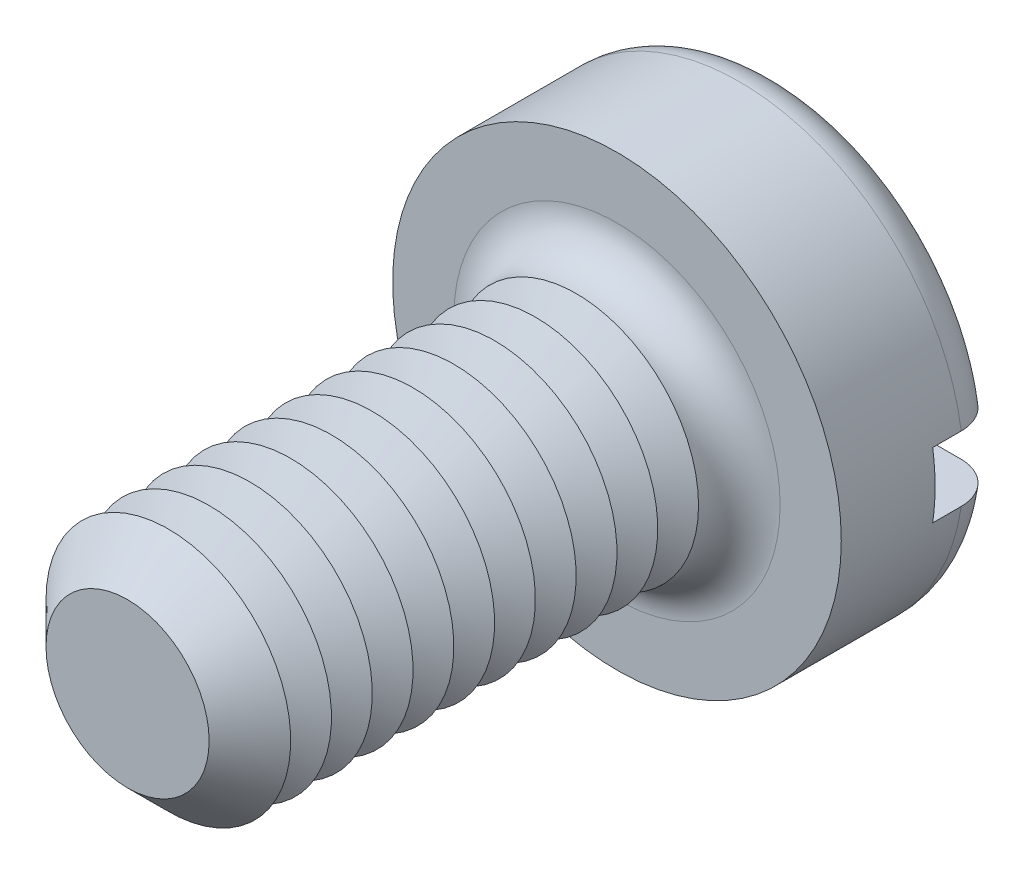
ISO-10303-21;
HEADER;
FILE_DESCRIPTION(('STEP AP214'),'2;1');
FILE_NAME('part.step','',(''),(''),'','','');
FILE_SCHEMA(('AUTOMOTIVE_DESIGN { 1 0 10303 214 1 1 1 1 }'));
ENDSEC;
DATA;
#1=APPLICATION_CONTEXT('core data for automotive mechanical design processes');
#2=APPLICATION_PROTOCOL_DEFINITION('international standard','automotive_design',2000,#1);
#3=PRODUCT_CONTEXT('',#1,'mechanical');
#4=PRODUCT('Part','Part','',(#3));
#5=PRODUCT_RELATED_PRODUCT_CATEGORY('part','',(#4));
#6=PRODUCT_DEFINITION_FORMATION('','',#4);
#7=PRODUCT_DEFINITION_CONTEXT('part definition',#1,'design');
#8=PRODUCT_DEFINITION('design','',#6,#7);
#9=PRODUCT_DEFINITION_SHAPE('','',#8);
#10=(LENGTH_UNIT() NAMED_UNIT(*) SI_UNIT(.MILLI.,.METRE.));
#11=(NAMED_UNIT(*) PLANE_ANGLE_UNIT() SI_UNIT($,.RADIAN.));
#12=(NAMED_UNIT(*) SI_UNIT($,.STERADIAN.) SOLID_ANGLE_UNIT());
#13=UNCERTAINTY_MEASURE_WITH_UNIT(LENGTH_MEASURE(1.E-05),#10,'distance_accuracy_value','');
#14=(GEOMETRIC_REPRESENTATION_CONTEXT(3) GLOBAL_UNCERTAINTY_ASSIGNED_CONTEXT((#13)) GLOBAL_UNIT_ASSIGNED_CONTEXT((#10,
#11,#12)) REPRESENTATION_CONTEXT('',''));
#15=CARTESIAN_POINT('',(0.,0.,0.));
#16=DIRECTION('',(0.,0.,1.));
#17=DIRECTION('',(1.,0.,0.));
#18=AXIS2_PLACEMENT_3D('',#15,#16,#17);
#19=CARTESIAN_POINT('',(0.,0.,-2.));
#20=DIRECTION('',(0.,0.,1.));
#21=DIRECTION('',(1.,0.,0.));
#22=AXIS2_PLACEMENT_3D('',#19,#20,#21);
#23=PLANE('',#22);
#24=CARTESIAN_POINT('',(0.,0.,-2.));
#25=DIRECTION('',(0.,0.,1.));
#26=DIRECTION('',(1.,0.,0.));
#27=AXIS2_PLACEMENT_3D('',#24,#25,#26);
#28=CIRCLE('',#27,2.25);
#29=CARTESIAN_POINT('',(-2.21415898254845,0.4,-2.));
#30=VERTEX_POINT('',#29);
#31=CARTESIAN_POINT('',(2.21415898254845,0.4,-2.));
#32=VERTEX_POINT('',#31);
#33=EDGE_CURVE('E116',#30,#32,#28,.F.);
#34=ORIENTED_EDGE('',*,*,#33,.T.);
#35=DIRECTION('',(1.,0.,0.));
#36=VECTOR('',#35,1.);
#37=CARTESIAN_POINT('',(-2.75,0.400000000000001,-2.));
#38=LINE('',#37,#36);
#39=EDGE_CURVE('E111',#30,#32,#38,.T.);
#40=ORIENTED_EDGE('',*,*,#39,.F.);
#41=EDGE_LOOP('',(#34,#40));
#42=FACE_BOUND('',#41,.T.);
#43=ADVANCED_FACE('F39',(#42),#23,.F.);
#44=CARTESIAN_POINT('',(0.,0.,-1.5));
#45=DIRECTION('',(0.,0.,1.));
#46=DIRECTION('',(1.,0.,0.));
#47=AXIS2_PLACEMENT_3D('',#44,#45,#46);
#48=TOROIDAL_SURFACE('',#47,2.25,0.5);
#49=CARTESIAN_POINT('',(-2.6296588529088,0.400000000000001,-1.78631483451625));
#50=CARTESIAN_POINT('',(-2.61332846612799,0.400000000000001,-1.80942627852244));
#51=CARTESIAN_POINT('',(-2.59501593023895,0.400000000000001,-1.83116426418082));
#52=CARTESIAN_POINT('',(-2.55497423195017,0.400000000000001,-1.87126271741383));
#53=CARTESIAN_POINT('',(-2.53324055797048,0.4,-1.88961865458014));
#54=CARTESIAN_POINT('',(-2.48702796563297,0.4,-1.92241505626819));
#55=CARTESIAN_POINT('',(-2.46255183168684,0.4,-1.93685944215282));
#56=CARTESIAN_POINT('',(-2.41154731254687,0.4,-1.96147315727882));
#57=CARTESIAN_POINT('',(-2.38501943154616,0.4,-1.97164353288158));
#58=CARTESIAN_POINT('',(-2.3303912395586,0.4,-1.98753780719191));
#59=CARTESIAN_POINT('',(-2.30227842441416,0.4,-1.99321871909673));
#60=CARTESIAN_POINT('',(-2.24549884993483,0.4,-1.99984170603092));
#61=CARTESIAN_POINT('',(-2.21683202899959,0.4,-2.00078325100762));
#62=CARTESIAN_POINT('',(-2.15939326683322,0.4,-1.99790249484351));
#63=CARTESIAN_POINT('',(-2.13062419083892,0.4,-1.99402290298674));
#64=CARTESIAN_POINT('',(-2.07413526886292,0.4,-1.98151915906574));
#65=CARTESIAN_POINT('',(-2.04641547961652,0.4,-1.97289475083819));
#66=CARTESIAN_POINT('',(-1.99264697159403,0.4,-1.95107177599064));
#67=CARTESIAN_POINT('',(-1.96660904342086,0.4,-1.93784659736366));
#68=CARTESIAN_POINT('',(-1.91713954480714,0.4,-1.90718730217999));
#69=CARTESIAN_POINT('',(-1.89370795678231,0.4,-1.88975321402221));
#70=CARTESIAN_POINT('',(-1.85029144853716,0.4,-1.85126548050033));
#71=CARTESIAN_POINT('',(-1.83028607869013,0.4,-1.83023492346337));
#72=CARTESIAN_POINT('',(-1.79417432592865,0.4,-1.78505552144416));
#73=CARTESIAN_POINT('',(-1.77806752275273,0.4,-1.76090701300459));
#74=CARTESIAN_POINT('',(-1.75056079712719,0.4,-1.71067721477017));
#75=CARTESIAN_POINT('',(-1.7390748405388,0.4,-1.68464306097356));
#76=CARTESIAN_POINT('',(-1.72075680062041,0.4,-1.63098625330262));
#77=CARTESIAN_POINT('',(-1.71392397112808,0.4,-1.60336385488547));
#78=CARTESIAN_POINT('',(-1.70525661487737,0.4,-1.54801066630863));
#79=CARTESIAN_POINT('',(-1.70330866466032,0.4,-1.52029759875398));
#80=CARTESIAN_POINT('',(-1.70414820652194,0.4,-1.46494458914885));
#81=CARTESIAN_POINT('',(-1.70693532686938,0.4,-1.43730464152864));
#82=CARTESIAN_POINT('',(-1.71709335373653,0.4,-1.38318389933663));
#83=CARTESIAN_POINT('',(-1.72441580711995,0.4,-1.35669397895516));
#84=CARTESIAN_POINT('',(-1.74335830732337,0.4,-1.30529964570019));
#85=CARTESIAN_POINT('',(-1.75497853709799,0.4,-1.2803953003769));
#86=CARTESIAN_POINT('',(-1.78229453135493,0.4,-1.23258298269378));
#87=CARTESIAN_POINT('',(-1.79803217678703,0.4,-1.20969896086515));
#88=CARTESIAN_POINT('',(-1.83304498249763,0.4,-1.16682064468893));
#89=CARTESIAN_POINT('',(-1.85232054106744,0.4,-1.1468266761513));
#90=CARTESIAN_POINT('',(-1.89433695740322,0.4,-1.10980713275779));
#91=CARTESIAN_POINT('',(-1.91714740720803,0.4,-1.09286053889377));
#92=CARTESIAN_POINT('',(-1.96524407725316,0.4,-1.06294809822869));
#93=CARTESIAN_POINT('',(-1.99053056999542,0.4,-1.04998269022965));
#94=CARTESIAN_POINT('',(-2.04340612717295,0.4,-1.02814800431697));
#95=CARTESIAN_POINT('',(-2.07103098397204,0.4,-1.01936532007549));
#96=CARTESIAN_POINT('',(-2.12735840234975,0.4,-1.00652373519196));
#97=CARTESIAN_POINT('',(-2.15606102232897,0.4,-1.00246509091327));
#98=CARTESIAN_POINT('',(-2.21395379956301,0.4,-0.999181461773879));
#99=CARTESIAN_POINT('',(-2.24314598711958,0.4,-0.999992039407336));
#100=CARTESIAN_POINT('',(-2.30097585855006,0.4,-1.00652779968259));
#101=CARTESIAN_POINT('',(-2.32961355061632,0.4,-1.01225290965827));
#102=CARTESIAN_POINT('',(-2.38536238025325,0.4,-1.02843951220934));
#103=CARTESIAN_POINT('',(-2.41248047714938,0.4,-1.03887701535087));
#104=CARTESIAN_POINT('',(-2.46454860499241,0.4,-1.06421009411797));
#105=CARTESIAN_POINT('',(-2.48949875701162,0.4,-1.0791054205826));
#106=CARTESIAN_POINT('',(-2.53620471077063,0.4,-1.11274531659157));
#107=CARTESIAN_POINT('',(-2.55799482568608,0.400000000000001,-1.1314422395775));
#108=CARTESIAN_POINT('',(-2.59807595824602,0.400000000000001,-1.17227176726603));
#109=CARTESIAN_POINT('',(-2.6163672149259,0.400000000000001,-1.19440413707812));
#110=CARTESIAN_POINT('',(-2.64868581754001,0.400000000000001,-1.24117072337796));
#111=CARTESIAN_POINT('',(-2.66276466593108,0.400000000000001,-1.26576935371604));
#112=CARTESIAN_POINT('',(-2.68654482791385,0.400000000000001,-1.31699754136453));
#113=CARTESIAN_POINT('',(-2.69624657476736,0.400000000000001,-1.34362689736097));
#114=CARTESIAN_POINT('',(-2.71090527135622,0.400000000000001,-1.39787706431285));
#115=CARTESIAN_POINT('',(-2.71590826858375,0.400000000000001,-1.4254854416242));
#116=CARTESIAN_POINT('',(-2.72118463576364,0.400000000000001,-1.48115803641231));
#117=CARTESIAN_POINT('',(-2.72145696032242,0.400000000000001,-1.50922235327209));
#118=CARTESIAN_POINT('',(-2.71727180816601,0.400000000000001,-1.56487271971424));
#119=CARTESIAN_POINT('',(-2.71283440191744,0.400000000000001,-1.59246029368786));
#120=CARTESIAN_POINT('',(-2.69939521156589,0.400000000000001,-1.64647499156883));
#121=CARTESIAN_POINT('',(-2.69039909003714,0.400000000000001,-1.67290351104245));
#122=CARTESIAN_POINT('',(-2.67251693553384,0.400000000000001,-1.71382731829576));
#123=CARTESIAN_POINT('',(-2.66497994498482,0.400000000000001,-1.72892686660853));
#124=CARTESIAN_POINT('',(-2.64841616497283,0.400000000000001,-1.75828509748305));
#125=CARTESIAN_POINT('',(-2.63938938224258,0.400000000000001,-1.77254378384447));
#126=CARTESIAN_POINT('',(-2.6296588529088,0.400000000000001,-1.78631483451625));
#127=B_SPLINE_CURVE_WITH_KNOTS('',3,(#49,#50,#51,#52,#53,#54,#55,#56,#57,#58,#59,#60,#61,#62,
#63,#64,#65,#66,#67,#68,#69,#70,#71,#72,#73,#74,#75,#76,#77,#78,#79,#80,#81,#82,#83,#84,#85,#86,
#87,#88,#89,#90,#91,#92,#93,#94,#95,#96,#97,#98,#99,#100,#101,#102,#103,#104,#105,#106,#107,
#108,#109,#110,#111,#112,#113,#114,#115,#116,#117,#118,#119,#120,#121,#122,#123,#124,#125,#126),
.UNSPECIFIED.,.T.,.F.,(4,2,2,2,2,2,2,2,2,2,2,2,2,2,2,2,2,2,2,2,2,2,2,2,2,2,2,2,2,2,2,2,2,2,2,2,
2,2,4),(0.,0.0848338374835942,0.16978050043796,0.254641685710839,0.339482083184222,
0.42512530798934,0.510778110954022,0.597458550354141,0.684143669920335,0.771338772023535,
0.858533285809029,0.945187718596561,1.03183280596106,1.11678035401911,1.20171427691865,
1.28465703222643,1.36759327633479,1.4496584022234,1.53172702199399,1.61466526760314,
1.69761285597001,1.78247103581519,1.86733856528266,1.95389396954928,2.0404540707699,
2.12764713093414,2.21483890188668,2.30159172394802,2.38833969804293,2.4740609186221,
2.55977628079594,2.6443962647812,2.72900787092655,2.81278135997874,2.89657336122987,
2.98000971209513,3.06334267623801,3.113891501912,3.16444009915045),.UNSPECIFIED.);
#128=CARTESIAN_POINT('',(-2.72075357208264,0.400000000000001,-1.50000000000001));
#129=VERTEX_POINT('',#128);
#130=EDGE_CURVE('E259',#129,#30,#127,.T.);
#131=ORIENTED_EDGE('',*,*,#130,.F.);
#132=CARTESIAN_POINT('',(0.,0.,-1.5));
#133=DIRECTION('',(0.,0.,1.));
#134=DIRECTION('',(1.,0.,0.));
#135=AXIS2_PLACEMENT_3D('',#132,#133,#134);
#136=CIRCLE('',#135,2.75);
#137=CARTESIAN_POINT('',(2.7207535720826,0.4,-1.5));
#138=VERTEX_POINT('',#137);
#139=EDGE_CURVE('E125',#138,#129,#136,.T.);
#140=ORIENTED_EDGE('',*,*,#139,.F.);
#141=CARTESIAN_POINT('',(1.7362507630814,0.4,-1.6752840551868));
#142=CARTESIAN_POINT('',(1.74636083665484,0.4,-1.70159961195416));
#143=CARTESIAN_POINT('',(1.7587429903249,0.4,-1.72706707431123));
#144=CARTESIAN_POINT('',(1.78764414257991,0.4,-1.77556609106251));
#145=CARTESIAN_POINT('',(1.80416918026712,0.4,-1.79859401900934));
#146=CARTESIAN_POINT('',(1.84080454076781,0.4,-1.84153587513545));
#147=CARTESIAN_POINT('',(1.86090949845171,0.4,-1.86145438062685));
#148=CARTESIAN_POINT('',(1.9041208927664,0.4,-1.89769607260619));
#149=CARTESIAN_POINT('',(1.92722659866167,0.4,-1.91402013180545));
#150=CARTESIAN_POINT('',(1.97620958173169,0.4,-1.94291288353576));
#151=CARTESIAN_POINT('',(2.00212726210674,0.4,-1.95541309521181));
#152=CARTESIAN_POINT('',(2.05567603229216,0.4,-1.97595143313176));
#153=CARTESIAN_POINT('',(2.08330733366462,0.4,-1.98398900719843));
#154=CARTESIAN_POINT('',(2.13989163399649,0.4,-1.99545904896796));
#155=CARTESIAN_POINT('',(2.16885726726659,0.4,-1.99882930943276));
#156=CARTESIAN_POINT('',(2.22694412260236,0.4,-2.00065872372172));
#157=CARTESIAN_POINT('',(2.25606534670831,0.4,-1.99911781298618));
#158=CARTESIAN_POINT('',(2.31362436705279,0.4,-1.99114818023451));
#159=CARTESIAN_POINT('',(2.34206235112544,0.4,-1.98472081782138));
#160=CARTESIAN_POINT('',(2.39743709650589,0.4,-1.96713601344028));
#161=CARTESIAN_POINT('',(2.42437392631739,0.4,-1.95597878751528));
#162=CARTESIAN_POINT('',(2.47569769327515,0.4,-1.92935960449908));
#163=CARTESIAN_POINT('',(2.50010686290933,0.4,-1.91394052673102));
#164=CARTESIAN_POINT('',(2.54594525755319,0.4,-1.8791725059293));
#165=CARTESIAN_POINT('',(2.56737468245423,0.4,-1.85982382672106));
#166=CARTESIAN_POINT('',(2.60634898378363,0.4,-1.81801641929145));
#167=CARTESIAN_POINT('',(2.6239407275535,0.4,-1.79560138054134));
#168=CARTESIAN_POINT('',(2.65505953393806,0.4,-1.7481077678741));
#169=CARTESIAN_POINT('',(2.66858686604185,0.4,-1.72302937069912));
#170=CARTESIAN_POINT('',(2.69103536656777,0.4,-1.67123055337));
#171=CARTESIAN_POINT('',(2.70000740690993,0.4,-1.64453217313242));
#172=CARTESIAN_POINT('',(2.71330608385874,0.4,-1.59000262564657));
#173=CARTESIAN_POINT('',(2.71763293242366,0.4,-1.5621715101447));
#174=CARTESIAN_POINT('',(2.72149675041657,0.4,-1.50637655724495));
#175=CARTESIAN_POINT('',(2.72106725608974,0.4,-1.47841503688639));
#176=CARTESIAN_POINT('',(2.7155123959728,0.4,-1.42296287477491));
#177=CARTESIAN_POINT('',(2.71038711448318,0.4,-1.39547222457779));
#178=CARTESIAN_POINT('',(2.69560462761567,0.4,-1.34178071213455));
#179=CARTESIAN_POINT('',(2.68595389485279,0.4,-1.31557806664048));
#180=CARTESIAN_POINT('',(2.66240876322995,0.4,-1.26515516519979));
#181=CARTESIAN_POINT('',(2.64851431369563,0.4,-1.24093493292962));
#182=CARTESIAN_POINT('',(2.61681930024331,0.4,-1.19504594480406));
#183=CARTESIAN_POINT('',(2.59900198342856,0.4,-1.17338876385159));
#184=CARTESIAN_POINT('',(2.56001495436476,0.4,-1.13333899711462));
#185=CARTESIAN_POINT('',(2.53884510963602,0.4,-1.11494654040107));
#186=CARTESIAN_POINT('',(2.49354554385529,0.4,-1.08175888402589));
#187=CARTESIAN_POINT('',(2.46938991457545,0.4,-1.06699905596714));
#188=CARTESIAN_POINT('',(2.41896725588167,0.4,-1.04168682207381));
#189=CARTESIAN_POINT('',(2.39270009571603,0.4,-1.03113467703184));
#190=CARTESIAN_POINT('',(2.33844927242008,0.4,-1.01439607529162));
#191=CARTESIAN_POINT('',(2.31044823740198,0.4,-1.00826592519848));
#192=CARTESIAN_POINT('',(2.25381752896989,0.4,-1.00073183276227));
#193=CARTESIAN_POINT('',(2.22518781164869,0.4,-0.999328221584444));
#194=CARTESIAN_POINT('',(2.16774231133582,0.4,-1.00127811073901));
#195=CARTESIAN_POINT('',(2.13892848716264,0.4,-1.00468955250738));
#196=CARTESIAN_POINT('',(2.08227193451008,0.4,-1.01626887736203));
#197=CARTESIAN_POINT('',(2.05442926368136,0.4,-1.02443704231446));
#198=CARTESIAN_POINT('',(2.00032604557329,0.4,-1.04537295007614));
#199=CARTESIAN_POINT('',(1.97407661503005,0.4,-1.05816944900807));
#200=CARTESIAN_POINT('',(1.92411255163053,0.4,-1.08801035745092));
#201=CARTESIAN_POINT('',(1.90039792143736,0.4,-1.10505477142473));
#202=CARTESIAN_POINT('',(1.85633574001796,0.4,-1.14282887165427));
#203=CARTESIAN_POINT('',(1.83597040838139,0.4,-1.16353779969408));
#204=CARTESIAN_POINT('',(1.79908731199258,0.4,-1.20813793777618));
#205=CARTESIAN_POINT('',(1.78256899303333,0.4,-1.23202868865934));
#206=CARTESIAN_POINT('',(1.75420022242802,0.4,-1.28183173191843));
#207=CARTESIAN_POINT('',(1.74226635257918,0.4,-1.30769648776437));
#208=CARTESIAN_POINT('',(1.72302798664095,0.4,-1.36110211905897));
#209=CARTESIAN_POINT('',(1.71572395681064,0.4,-1.38864316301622));
#210=CARTESIAN_POINT('',(1.70611974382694,0.4,-1.44392326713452));
#211=CARTESIAN_POINT('',(1.70370764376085,0.4,-1.47164298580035));
#212=CARTESIAN_POINT('',(1.70363822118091,0.4,-1.52706336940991));
#213=CARTESIAN_POINT('',(1.70597448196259,0.4,-1.55476400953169));
#214=CARTESIAN_POINT('',(1.71335146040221,0.4,-1.59796127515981));
#215=CARTESIAN_POINT('',(1.71686033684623,0.4,-1.61373520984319));
#216=CARTESIAN_POINT('',(1.7254146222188,0.4,-1.64486018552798));
#217=CARTESIAN_POINT('',(1.73045999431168,0.4,-1.66021123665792));
#218=CARTESIAN_POINT('',(1.7362507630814,0.4,-1.6752840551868));
#219=B_SPLINE_CURVE_WITH_KNOTS('',3,(#141,#142,#143,#144,#145,#146,#147,#148,#149,#150,#151,
#152,#153,#154,#155,#156,#157,#158,#159,#160,#161,#162,#163,#164,#165,#166,#167,#168,#169,#170,
#171,#172,#173,#174,#175,#176,#177,#178,#179,#180,#181,#182,#183,#184,#185,#186,#187,#188,#189,
#190,#191,#192,#193,#194,#195,#196,#197,#198,#199,#200,#201,#202,#203,#204,#205,#206,#207,#208,
#209,#210,#211,#212,#213,#214,#215,#216,#217,#218),.UNSPECIFIED.,.T.,.F.,(4,2,2,2,2,2,2,2,2,2,2,
2,2,2,2,2,2,2,2,2,2,2,2,2,2,2,2,2,2,2,2,2,2,2,2,2,2,2,4),(0.,0.0845117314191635,
0.169147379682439,0.253657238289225,0.338146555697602,0.424070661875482,0.510005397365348,
0.597074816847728,0.684145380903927,0.771191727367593,0.858234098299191,0.94443074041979,
1.03062159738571,1.11569223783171,1.20075723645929,1.28485012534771,1.36893917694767,
1.45243570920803,1.53593074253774,1.61930671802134,1.70268368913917,1.7864238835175,
1.87016738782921,1.95469664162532,2.03923113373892,2.12482389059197,2.21042264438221,
2.29706026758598,2.38370302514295,2.47089361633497,2.55808429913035,2.64479602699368,
2.73149525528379,2.81653234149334,2.9015779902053,2.98465497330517,3.06761976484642,
3.11602689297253,3.164432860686),.UNSPECIFIED.);
#220=EDGE_CURVE('E261',#32,#138,#219,.T.);
#221=ORIENTED_EDGE('',*,*,#220,.F.);
#222=ORIENTED_EDGE('',*,*,#33,.F.);
#223=EDGE_LOOP('',(#131,#140,#221,#222));
#224=FACE_BOUND('',#223,.T.);
#225=ADVANCED_FACE('F243',(#224),#48,.T.);
#226=CARTESIAN_POINT('',(0.,0.,-2.));
#227=DIRECTION('',(0.,0.,1.));
#228=DIRECTION('',(1.,0.,0.));
#229=AXIS2_PLACEMENT_3D('',#226,#227,#228);
#230=CYLINDRICAL_SURFACE('',#229,2.75);
#231=DIRECTION('',(0.,0.,1.));
#232=VECTOR('',#231,1.);
#233=CARTESIAN_POINT('',(2.72075357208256,0.4,-2.));
#234=LINE('',#233,#232);
#235=CARTESIAN_POINT('',(2.72075357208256,0.4,-1.15));
#236=VERTEX_POINT('',#235);
#237=EDGE_CURVE('E276',#138,#236,#234,.T.);
#238=ORIENTED_EDGE('',*,*,#237,.F.);
#239=ORIENTED_EDGE('',*,*,#139,.T.);
#240=DIRECTION('',(0.,0.,1.));
#241=VECTOR('',#240,1.);
#242=CARTESIAN_POINT('',(-2.72075357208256,0.4,-2.));
#243=LINE('',#242,#241);
#244=CARTESIAN_POINT('',(-2.72075357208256,0.4,-1.15));
#245=VERTEX_POINT('',#244);
#246=EDGE_CURVE('E63',#245,#129,#243,.F.);
#247=ORIENTED_EDGE('',*,*,#246,.F.);
#248=CARTESIAN_POINT('',(0.,0.,-1.15));
#249=DIRECTION('',(0.,0.,-1.));
#250=DIRECTION('',(-1.,0.,0.));
#251=AXIS2_PLACEMENT_3D('',#248,#249,#250);
#252=CIRCLE('',#251,2.75);
#253=CARTESIAN_POINT('',(-2.72075357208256,-0.4,-1.15));
#254=VERTEX_POINT('',#253);
#255=EDGE_CURVE('E43',#245,#254,#252,.F.);
#256=ORIENTED_EDGE('',*,*,#255,.T.);
#257=DIRECTION('',(0.,0.,1.));
#258=VECTOR('',#257,1.);
#259=CARTESIAN_POINT('',(-2.72075357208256,-0.4,-2.));
#260=LINE('',#259,#258);
#261=CARTESIAN_POINT('',(-2.72075357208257,-0.4,-1.5));
#262=VERTEX_POINT('',#261);
#263=EDGE_CURVE('E273',#262,#254,#260,.T.);
#264=ORIENTED_EDGE('',*,*,#263,.F.);
#265=CARTESIAN_POINT('',(2.72075357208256,-0.4,-1.5));
#266=VERTEX_POINT('',#265);
#267=EDGE_CURVE('E127',#262,#266,#136,.T.);
#268=ORIENTED_EDGE('',*,*,#267,.T.);
#269=DIRECTION('',(0.,0.,1.));
#270=VECTOR('',#269,1.);
#271=CARTESIAN_POINT('',(2.72075357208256,-0.4,-2.));
#272=LINE('',#271,#270);
#273=CARTESIAN_POINT('',(2.72075357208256,-0.4,-1.15));
#274=VERTEX_POINT('',#273);
#275=EDGE_CURVE('E55',#274,#266,#272,.F.);
#276=ORIENTED_EDGE('',*,*,#275,.F.);
#277=EDGE_CURVE('E11',#274,#236,#252,.F.);
#278=ORIENTED_EDGE('',*,*,#277,.T.);
#279=EDGE_LOOP('',(#238,#239,#247,#256,#264,#268,#276,#278));
#280=FACE_BOUND('',#279,.T.);
#281=CARTESIAN_POINT('',(0.,0.,0.));
#282=DIRECTION('',(0.,0.,1.));
#283=DIRECTION('',(1.,0.,0.));
#284=AXIS2_PLACEMENT_3D('',#281,#282,#283);
#285=CIRCLE('',#284,2.75);
#286=CARTESIAN_POINT('',(2.75,0.,0.));
#287=VERTEX_POINT('',#286);
#288=EDGE_CURVE('E279',#287,#287,#285,.T.);
#289=ORIENTED_EDGE('',*,*,#288,.F.);
#290=EDGE_LOOP('',(#289));
#291=FACE_BOUND('',#290,.T.);
#292=ADVANCED_FACE('F239',(#280,#291),#230,.T.);
#293=CARTESIAN_POINT('',(2.21415898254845,-0.4,-2.));
#294=VERTEX_POINT('',#293);
#295=CARTESIAN_POINT('',(-2.21415898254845,-0.4,-2.));
#296=VERTEX_POINT('',#295);
#297=EDGE_CURVE('E109',#294,#296,#28,.F.);
#298=ORIENTED_EDGE('',*,*,#297,.T.);
#299=DIRECTION('',(-1.,0.,0.));
#300=VECTOR('',#299,1.);
#301=CARTESIAN_POINT('',(-2.75,-0.4,-2.));
#302=LINE('',#301,#300);
#303=EDGE_CURVE('E96',#294,#296,#302,.T.);
#304=ORIENTED_EDGE('',*,*,#303,.F.);
#305=EDGE_LOOP('',(#298,#304));
#306=FACE_BOUND('',#305,.T.);
#307=ADVANCED_FACE('F108',(#306),#23,.F.);
#308=CARTESIAN_POINT('',(0.,0.,0.));
#309=DIRECTION('',(0.,0.,1.));
#310=DIRECTION('',(1.,0.,0.));
#311=AXIS2_PLACEMENT_3D('',#308,#309,#310);
#312=PLANE('',#311);
#313=CARTESIAN_POINT('',(0.,0.,0.));
#314=DIRECTION('',(0.,0.,1.));
#315=DIRECTION('',(1.,0.,0.));
#316=AXIS2_PLACEMENT_3D('',#313,#314,#315);
#317=CIRCLE('',#316,2.);
#318=CARTESIAN_POINT('',(2.,0.,0.));
#319=VERTEX_POINT('',#318);
#320=EDGE_CURVE('E115',#319,#319,#317,.F.);
#321=ORIENTED_EDGE('',*,*,#320,.T.);
#322=EDGE_LOOP('',(#321));
#323=FACE_BOUND('',#322,.T.);
#324=ORIENTED_EDGE('',*,*,#288,.T.);
#325=EDGE_LOOP('',(#324));
#326=FACE_BOUND('',#325,.T.);
#327=ADVANCED_FACE('F238',(#323,#326),#312,.T.);
#328=CARTESIAN_POINT('',(-2.6296588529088,-0.4,-1.78631483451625));
#329=CARTESIAN_POINT('',(-2.64575286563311,-0.4,-1.76353353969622));
#330=CARTESIAN_POINT('',(-2.65994473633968,-0.4,-1.73938506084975));
#331=CARTESIAN_POINT('',(-2.68408879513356,-0.4,-1.68903091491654));
#332=CARTESIAN_POINT('',(-2.69403633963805,-0.4,-1.6628230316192));
#333=CARTESIAN_POINT('',(-2.70937899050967,-0.4,-1.60911025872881));
#334=CARTESIAN_POINT('',(-2.71477511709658,-0.4,-1.5816056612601));
#335=CARTESIAN_POINT('',(-2.72085365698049,-0.4,-1.52608718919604));
#336=CARTESIAN_POINT('',(-2.7215371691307,-0.4,-1.49807343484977));
#337=CARTESIAN_POINT('',(-2.71817903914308,-0.4,-1.44242333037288));
#338=CARTESIAN_POINT('',(-2.71415291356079,-0.4,-1.41478604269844));
#339=CARTESIAN_POINT('',(-2.70152104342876,-0.4,-1.36057835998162));
#340=CARTESIAN_POINT('',(-2.69291517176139,-0.4,-1.33400799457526));
#341=CARTESIAN_POINT('',(-2.67137052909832,-0.4,-1.28266198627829));
#342=CARTESIAN_POINT('',(-2.65842829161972,-0.4,-1.25788779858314));
#343=CARTESIAN_POINT('',(-2.62859348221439,-0.4,-1.21084577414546));
#344=CARTESIAN_POINT('',(-2.61170082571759,-0.4,-1.18857799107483));
#345=CARTESIAN_POINT('',(-2.5743351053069,-0.4,-1.1470221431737));
#346=CARTESIAN_POINT('',(-2.55383974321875,-0.4,-1.12775413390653));
#347=CARTESIAN_POINT('',(-2.5099353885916,-0.4,-1.09288845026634));
#348=CARTESIAN_POINT('',(-2.48652625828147,-0.4,-1.07729094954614));
#349=CARTESIAN_POINT('',(-2.43718903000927,-0.4,-1.0500239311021));
#350=CARTESIAN_POINT('',(-2.41123629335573,-0.4,-1.0383990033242));
#351=CARTESIAN_POINT('',(-2.35776417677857,-0.4,-1.01960886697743));
#352=CARTESIAN_POINT('',(-2.33024469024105,-0.4,-1.01244396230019));
#353=CARTESIAN_POINT('',(-2.27404134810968,-0.4,-1.00268156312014));
#354=CARTESIAN_POINT('',(-2.24534705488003,-0.4,-1.00014414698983));
#355=CARTESIAN_POINT('',(-2.18793513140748,-0.4,-0.999867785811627));
#356=CARTESIAN_POINT('',(-2.15921749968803,-0.4,-1.00212917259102));
#357=CARTESIAN_POINT('',(-2.10225052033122,-0.4,-1.01142552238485));
#358=CARTESIAN_POINT('',(-2.07400941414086,-0.4,-1.01851105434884));
#359=CARTESIAN_POINT('',(-2.01911044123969,-0.4,-1.03730994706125));
#360=CARTESIAN_POINT('',(-1.99245264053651,-0.4,-1.04902350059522));
#361=CARTESIAN_POINT('',(-1.94142108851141,-0.4,-1.07679847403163));
#362=CARTESIAN_POINT('',(-1.91705303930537,-0.4,-1.09287038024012));
#363=CARTESIAN_POINT('',(-1.87139758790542,-0.4,-1.12891897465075));
#364=CARTESIAN_POINT('',(-1.85011007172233,-0.4,-1.14889551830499));
#365=CARTESIAN_POINT('',(-1.81149058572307,-0.4,-1.19196940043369));
#366=CARTESIAN_POINT('',(-1.79411779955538,-0.4,-1.21503011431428));
#367=CARTESIAN_POINT('',(-1.76359546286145,-0.4,-1.26379588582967));
#368=CARTESIAN_POINT('',(-1.75044532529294,-0.4,-1.28950057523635));
#369=CARTESIAN_POINT('',(-1.72906221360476,-0.4,-1.3422057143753));
#370=CARTESIAN_POINT('',(-1.72072512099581,-0.4,-1.3691639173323));
#371=CARTESIAN_POINT('',(-1.70880448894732,-0.4,-1.42411084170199));
#372=CARTESIAN_POINT('',(-1.7052202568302,-0.4,-1.45209941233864));
#373=CARTESIAN_POINT('',(-1.70295553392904,-0.4,-1.50768522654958));
#374=CARTESIAN_POINT('',(-1.70417398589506,-0.4,-1.53527840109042));
#375=CARTESIAN_POINT('',(-1.71124536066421,-0.4,-1.58986292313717));
#376=CARTESIAN_POINT('',(-1.71709811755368,-0.4,-1.61685429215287));
#377=CARTESIAN_POINT('',(-1.73321132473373,-0.4,-1.66938107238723));
#378=CARTESIAN_POINT('',(-1.74345625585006,-0.4,-1.69492125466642));
#379=CARTESIAN_POINT('',(-1.76802111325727,-0.4,-1.74395877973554));
#380=CARTESIAN_POINT('',(-1.78234133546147,-0.4,-1.76745597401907));
#381=CARTESIAN_POINT('',(-1.81488631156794,-0.4,-1.81216193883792));
#382=CARTESIAN_POINT('',(-1.83317116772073,-0.4,-1.83332693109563));
#383=CARTESIAN_POINT('',(-1.87296030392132,-0.4,-1.872375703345));
#384=CARTESIAN_POINT('',(-1.89446497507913,-0.4,-1.89025908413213));
#385=CARTESIAN_POINT('',(-1.94063077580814,-0.4,-1.92267732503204));
#386=CARTESIAN_POINT('',(-1.96535444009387,-0.4,-1.93712316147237));
#387=CARTESIAN_POINT('',(-2.01684705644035,-0.4,-1.96173690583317));
#388=CARTESIAN_POINT('',(-2.04361620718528,-0.4,-1.97190439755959));
#389=CARTESIAN_POINT('',(-2.09891021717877,-0.4,-1.9878230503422));
#390=CARTESIAN_POINT('',(-2.12745653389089,-0.4,-1.99349978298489));
#391=CARTESIAN_POINT('',(-2.18509639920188,-0.4,-1.99999556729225));
#392=CARTESIAN_POINT('',(-2.21418994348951,-0.4,-2.00081465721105));
#393=CARTESIAN_POINT('',(-2.27218032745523,-0.4,-1.99755156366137));
#394=CARTESIAN_POINT('',(-2.30107643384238,-0.4,-1.99345627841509));
#395=CARTESIAN_POINT('',(-2.35776697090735,-0.4,-1.98043125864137));
#396=CARTESIAN_POINT('',(-2.38556116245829,-0.4,-1.97150048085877));
#397=CARTESIAN_POINT('',(-2.43901832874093,-0.4,-1.94912081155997));
#398=CARTESIAN_POINT('',(-2.46469578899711,-0.4,-1.93570648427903));
#399=CARTESIAN_POINT('',(-2.51337022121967,-0.4,-1.90471183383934));
#400=CARTESIAN_POINT('',(-2.53637056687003,-0.4,-1.88713684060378));
#401=CARTESIAN_POINT('',(-2.57111030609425,-0.4,-1.85552084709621));
#402=CARTESIAN_POINT('',(-2.58386709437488,-0.4,-1.84257896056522));
#403=CARTESIAN_POINT('',(-2.60790410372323,-0.4,-1.81538935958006));
#404=CARTESIAN_POINT('',(-2.61918433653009,-0.4,-1.80114165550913));
#405=CARTESIAN_POINT('',(-2.6296588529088,-0.4,-1.78631483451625));
#406=B_SPLINE_CURVE_WITH_KNOTS('',3,(#328,#329,#330,#331,#332,#333,#334,#335,#336,#337,#338,
#339,#340,#341,#342,#343,#344,#345,#346,#347,#348,#349,#350,#351,#352,#353,#354,#355,#356,#357,
#358,#359,#360,#361,#362,#363,#364,#365,#366,#367,#368,#369,#370,#371,#372,#373,#374,#375,#376,
#377,#378,#379,#380,#381,#382,#383,#384,#385,#386,#387,#388,#389,#390,#391,#392,#393,#394,#395,
#396,#397,#398,#399,#400,#401,#402,#403,#404,#405),.UNSPECIFIED.,.T.,.F.,(4,2,2,2,2,2,2,2,2,2,2,
2,2,2,2,2,2,2,2,2,2,2,2,2,2,2,2,2,2,2,2,2,2,2,2,2,2,2,4),(0.,0.0836125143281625,
0.167316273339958,0.251001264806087,0.334666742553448,0.418057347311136,0.501450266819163,
0.584910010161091,0.668371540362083,0.752369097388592,0.836370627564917,0.921286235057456,
1.00620762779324,1.09222390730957,1.17824613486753,1.26518425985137,1.35212600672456,
1.43927882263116,1.52642841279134,1.61262232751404,1.69880425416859,1.7830443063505,
1.86727208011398,1.9497371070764,2.03219918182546,2.1143722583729,2.19655130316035,
2.28007615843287,2.36361116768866,2.44911836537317,2.53463387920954,2.62153862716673,
2.70844269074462,2.79557895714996,2.88273403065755,2.96923214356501,3.05562004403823,
3.11003826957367,3.16445606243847),.UNSPECIFIED.);
#407=EDGE_CURVE('E103',#296,#262,#406,.T.);
#408=ORIENTED_EDGE('',*,*,#407,.F.);
#409=ORIENTED_EDGE('',*,*,#297,.F.);
#410=CARTESIAN_POINT('',(1.7362507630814,-0.4,-1.6752840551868));
#411=CARTESIAN_POINT('',(1.72641416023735,-0.4,-1.64967314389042));
#412=CARTESIAN_POINT('',(1.71871480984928,-0.4,-1.62322216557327));
#413=CARTESIAN_POINT('',(1.70786038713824,-0.4,-1.56938399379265));
#414=CARTESIAN_POINT('',(1.70470970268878,-0.4,-1.54199592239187));
#415=CARTESIAN_POINT('',(1.70306971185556,-0.4,-1.48708393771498));
#416=CARTESIAN_POINT('',(1.70457942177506,-0.4,-1.45956005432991));
#417=CARTESIAN_POINT('',(1.71220670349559,-0.4,-1.40516538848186));
#418=CARTESIAN_POINT('',(1.71832341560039,-0.4,-1.3782944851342));
#419=CARTESIAN_POINT('',(1.73494792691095,-0.4,-1.32598312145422));
#420=CARTESIAN_POINT('',(1.74545076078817,-0.4,-1.30054108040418));
#421=CARTESIAN_POINT('',(1.77051013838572,-0.4,-1.25173932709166));
#422=CARTESIAN_POINT('',(1.7850670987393,-0.4,-1.22837982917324));
#423=CARTESIAN_POINT('',(1.81806903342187,-0.4,-1.1839775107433));
#424=CARTESIAN_POINT('',(1.8365752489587,-0.4,-1.16298023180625));
#425=CARTESIAN_POINT('',(1.87677669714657,-0.4,-1.1243010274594));
#426=CARTESIAN_POINT('',(1.89847230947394,-0.4,-1.10661949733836));
#427=CARTESIAN_POINT('',(1.94498854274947,-0.4,-1.07463966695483));
#428=CARTESIAN_POINT('',(1.96987078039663,-0.4,-1.06043095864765));
#429=CARTESIAN_POINT('',(2.02163980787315,-0.4,-1.0363161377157));
#430=CARTESIAN_POINT('',(2.04852678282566,-0.4,-1.02641042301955));
#431=CARTESIAN_POINT('',(2.10400319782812,-0.4,-1.01104128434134));
#432=CARTESIAN_POINT('',(2.13261287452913,-0.4,-1.00565079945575));
#433=CARTESIAN_POINT('',(2.19033179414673,-0.4,-0.999735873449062));
#434=CARTESIAN_POINT('',(2.2194410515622,-0.4,-0.999211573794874));
#435=CARTESIAN_POINT('',(2.27740442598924,-0.4,-1.00306591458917));
#436=CARTESIAN_POINT('',(2.30625777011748,-0.4,-1.00745623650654));
#437=CARTESIAN_POINT('',(2.36280530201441,-0.4,-1.02105937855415));
#438=CARTESIAN_POINT('',(2.39049952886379,-0.4,-1.03027203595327));
#439=CARTESIAN_POINT('',(2.44369359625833,-0.4,-1.05318710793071));
#440=CARTESIAN_POINT('',(2.46920965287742,-0.4,-1.0668518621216));
#441=CARTESIAN_POINT('',(2.51754507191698,-0.4,-1.09832423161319));
#442=CARTESIAN_POINT('',(2.54036461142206,-0.4,-1.11613157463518));
#443=CARTESIAN_POINT('',(2.58234752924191,-0.4,-1.15513986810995));
#444=CARTESIAN_POINT('',(2.601553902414,-0.4,-1.1762945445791));
#445=CARTESIAN_POINT('',(2.63609001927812,-0.4,-1.22156192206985));
#446=CARTESIAN_POINT('',(2.65142002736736,-0.4,-1.24567442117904));
#447=CARTESIAN_POINT('',(2.67757733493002,-0.4,-1.29585881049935));
#448=CARTESIAN_POINT('',(2.68845668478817,-0.4,-1.32190357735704));
#449=CARTESIAN_POINT('',(2.7056478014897,-0.4,-1.375459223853));
#450=CARTESIAN_POINT('',(2.71195980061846,-0.4,-1.40297002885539));
#451=CARTESIAN_POINT('',(2.71979288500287,-0.4,-1.45843707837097));
#452=CARTESIAN_POINT('',(2.72135241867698,-0.4,-1.48638789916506));
#453=CARTESIAN_POINT('',(2.71974298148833,-0.4,-1.54215266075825));
#454=CARTESIAN_POINT('',(2.71657412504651,-0.4,-1.56996660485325));
#455=CARTESIAN_POINT('',(2.70561779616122,-0.4,-1.62459191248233));
#456=CARTESIAN_POINT('',(2.69784258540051,-0.4,-1.65140573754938));
#457=CARTESIAN_POINT('',(2.6779146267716,-0.4,-1.70335337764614));
#458=CARTESIAN_POINT('',(2.66576185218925,-0.4,-1.72848718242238));
#459=CARTESIAN_POINT('',(2.63739107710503,-0.4,-1.77645196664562));
#460=CARTESIAN_POINT('',(2.62116029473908,-0.4,-1.79927538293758));
#461=CARTESIAN_POINT('',(2.58512700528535,-0.4,-1.84190182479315));
#462=CARTESIAN_POINT('',(2.56532438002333,-0.4,-1.86170475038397));
#463=CARTESIAN_POINT('',(2.522535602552,-0.4,-1.89791219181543));
#464=CARTESIAN_POINT('',(2.49952399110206,-0.4,-1.91428661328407));
#465=CARTESIAN_POINT('',(2.45110500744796,-0.4,-1.94299324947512));
#466=CARTESIAN_POINT('',(2.4256974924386,-0.4,-1.95532522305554));
#467=CARTESIAN_POINT('',(2.37288090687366,-0.4,-1.97575769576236));
#468=CARTESIAN_POINT('',(2.34545135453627,-0.4,-1.98380524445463));
#469=CARTESIAN_POINT('',(2.28963821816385,-0.4,-1.99524443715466));
#470=CARTESIAN_POINT('',(2.26125456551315,-0.4,-1.99863574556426));
#471=CARTESIAN_POINT('',(2.20395671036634,-0.4,-2.00070487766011));
#472=CARTESIAN_POINT('',(2.17504033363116,-0.4,-1.99932265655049));
#473=CARTESIAN_POINT('',(2.11784130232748,-0.4,-1.9917648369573));
#474=CARTESIAN_POINT('',(2.08955866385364,-0.4,-1.98558911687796));
#475=CARTESIAN_POINT('',(2.03419451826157,-0.4,-1.96854979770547));
#476=CARTESIAN_POINT('',(2.00712437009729,-0.4,-1.95764925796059));
#477=CARTESIAN_POINT('',(1.95519572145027,-0.4,-1.93144413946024));
#478=CARTESIAN_POINT('',(1.93033780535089,-0.4,-1.91613840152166));
#479=CARTESIAN_POINT('',(1.88362525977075,-0.4,-1.88157419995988));
#480=CARTESIAN_POINT('',(1.86176428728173,-0.4,-1.86232430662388));
#481=CARTESIAN_POINT('',(1.82167218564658,-0.4,-1.82038600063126));
#482=CARTESIAN_POINT('',(1.803436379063,-0.4,-1.7977020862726));
#483=CARTESIAN_POINT('',(1.77700088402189,-0.4,-1.7582526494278));
#484=CARTESIAN_POINT('',(1.7675549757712,-0.4,-1.74230781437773));
#485=CARTESIAN_POINT('',(1.75049861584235,-0.4,-1.70946415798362));
#486=CARTESIAN_POINT('',(1.7428881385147,-0.4,-1.69256534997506));
#487=CARTESIAN_POINT('',(1.7362507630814,-0.4,-1.6752840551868));
#488=B_SPLINE_CURVE_WITH_KNOTS('',3,(#410,#411,#412,#413,#414,#415,#416,#417,#418,#419,#420,
#421,#422,#423,#424,#425,#426,#427,#428,#429,#430,#431,#432,#433,#434,#435,#436,#437,#438,#439,
#440,#441,#442,#443,#444,#445,#446,#447,#448,#449,#450,#451,#452,#453,#454,#455,#456,#457,#458,
#459,#460,#461,#462,#463,#464,#465,#466,#467,#468,#469,#470,#471,#472,#473,#474,#475,#476,#477,
#478,#479,#480,#481,#482,#483,#484,#485,#486,#487),.UNSPECIFIED.,.T.,.F.,(4,2,2,2,2,2,2,2,2,2,2,
2,2,2,2,2,2,2,2,2,2,2,2,2,2,2,2,2,2,2,2,2,2,2,2,2,2,2,4),(0.,0.0822382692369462,
0.164555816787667,0.246855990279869,0.329140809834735,0.411332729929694,0.493533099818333,
0.577115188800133,0.660707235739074,0.746270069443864,0.831840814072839,0.918768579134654,
1.00569887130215,1.09283622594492,1.17997064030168,1.26638632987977,1.35279634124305,
1.43810213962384,1.52340211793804,1.60767384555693,1.69194128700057,1.77552515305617,
1.85910699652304,1.94246734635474,2.02582820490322,2.10945367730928,2.19308191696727,
2.2774160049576,2.36175512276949,2.4471137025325,2.53247843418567,2.61892083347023,
2.70536542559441,2.79249842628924,2.87965437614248,2.96662291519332,3.05347850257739,
3.10897061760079,3.16446195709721),.UNSPECIFIED.);
#489=EDGE_CURVE('E92',#266,#294,#488,.T.);
#490=ORIENTED_EDGE('',*,*,#489,.F.);
#491=ORIENTED_EDGE('',*,*,#267,.F.);
#492=EDGE_LOOP('',(#408,#409,#490,#491));
#493=FACE_BOUND('',#492,.T.);
#494=ADVANCED_FACE('F113',(#493),#48,.T.);
#495=CARTESIAN_POINT('',(0.,0.,0.5));
#496=DIRECTION('',(0.,0.,1.));
#497=DIRECTION('',(1.,0.,0.));
#498=AXIS2_PLACEMENT_3D('',#495,#496,#497);
#499=TOROIDAL_SURFACE('',#498,2.,0.5);
#500=ORIENTED_EDGE('',*,*,#320,.F.);
#501=EDGE_LOOP('',(#500));
#502=FACE_BOUND('',#501,.T.);
#503=CARTESIAN_POINT('',(0.,0.,0.5));
#504=DIRECTION('',(0.,0.,-1.));
#505=DIRECTION('',(-1.,0.,0.));
#506=AXIS2_PLACEMENT_3D('',#503,#504,#505);
#507=CIRCLE('',#506,1.5);
#508=CARTESIAN_POINT('',(-1.5,0.,0.5));
#509=VERTEX_POINT('',#508);
#510=EDGE_CURVE('E283',#509,#509,#507,.T.);
#511=ORIENTED_EDGE('',*,*,#510,.T.);
#512=EDGE_LOOP('',(#511));
#513=FACE_BOUND('',#512,.T.);
#514=ADVANCED_FACE('F231',(#502,#513),#499,.F.);
#515=CARTESIAN_POINT('',(0.,0.,0.75));
#516=DIRECTION('',(0.,0.,-1.));
#517=DIRECTION('',(-1.,0.,0.));
#518=AXIS2_PLACEMENT_3D('',#515,#516,#517);
#519=CONICAL_SURFACE('',#518,1.06698729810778,1.0471975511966);
#520=ORIENTED_EDGE('',*,*,#510,.F.);
#521=EDGE_LOOP('',(#520));
#522=FACE_BOUND('',#521,.T.);
#523=CARTESIAN_POINT('',(0.,0.,0.75));
#524=DIRECTION('',(0.,0.,-1.));
#525=DIRECTION('',(-1.,0.,0.));
#526=AXIS2_PLACEMENT_3D('',#523,#524,#525);
#527=CIRCLE('',#526,1.06698729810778);
#528=CARTESIAN_POINT('',(-1.06698729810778,0.,0.75));
#529=VERTEX_POINT('',#528);
#530=EDGE_CURVE('E288',#529,#529,#527,.T.);
#531=ORIENTED_EDGE('',*,*,#530,.T.);
#532=EDGE_LOOP('',(#531));
#533=FACE_BOUND('',#532,.T.);
#534=ADVANCED_FACE('F227',(#522,#533),#519,.T.);
#535=CARTESIAN_POINT('',(0.,0.,1.));
#536=DIRECTION('',(0.,0.,1.));
#537=DIRECTION('',(1.,0.,0.));
#538=AXIS2_PLACEMENT_3D('',#535,#536,#537);
#539=CONICAL_SURFACE('',#538,1.5,1.0471975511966);
#540=ORIENTED_EDGE('',*,*,#530,.F.);
#541=EDGE_LOOP('',(#540));
#542=FACE_BOUND('',#541,.T.);
#543=CARTESIAN_POINT('',(0.,0.,1.));
#544=DIRECTION('',(0.,0.,-1.));
#545=DIRECTION('',(-1.,0.,0.));
#546=AXIS2_PLACEMENT_3D('',#543,#544,#545);
#547=CIRCLE('',#546,1.5);
#548=CARTESIAN_POINT('',(-1.5,0.,1.));
#549=VERTEX_POINT('',#548);
#550=EDGE_CURVE('E294',#549,#549,#547,.T.);
#551=ORIENTED_EDGE('',*,*,#550,.T.);
#552=EDGE_LOOP('',(#551));
#553=FACE_BOUND('',#552,.T.);
#554=ADVANCED_FACE('F223',(#542,#553),#539,.T.);
#555=CARTESIAN_POINT('',(0.,0.,1.25));
#556=DIRECTION('',(0.,0.,-1.));
#557=DIRECTION('',(-1.,0.,0.));
#558=AXIS2_PLACEMENT_3D('',#555,#556,#557);
#559=CONICAL_SURFACE('',#558,1.06698729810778,1.0471975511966);
#560=ORIENTED_EDGE('',*,*,#550,.F.);
#561=EDGE_LOOP('',(#560));
#562=FACE_BOUND('',#561,.T.);
#563=CARTESIAN_POINT('',(0.,0.,1.25));
#564=DIRECTION('',(0.,0.,-1.));
#565=DIRECTION('',(-1.,0.,0.));
#566=AXIS2_PLACEMENT_3D('',#563,#564,#565);
#567=CIRCLE('',#566,1.06698729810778);
#568=CARTESIAN_POINT('',(-1.06698729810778,0.,1.25));
#569=VERTEX_POINT('',#568);
#570=EDGE_CURVE('E298',#569,#569,#567,.T.);
#571=ORIENTED_EDGE('',*,*,#570,.T.);
#572=EDGE_LOOP('',(#571));
#573=FACE_BOUND('',#572,.T.);
#574=ADVANCED_FACE('F219',(#562,#573),#559,.T.);
#575=CARTESIAN_POINT('',(0.,0.,1.5));
#576=DIRECTION('',(0.,0.,1.));
#577=DIRECTION('',(1.,0.,0.));
#578=AXIS2_PLACEMENT_3D('',#575,#576,#577);
#579=CONICAL_SURFACE('',#578,1.5,1.0471975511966);
#580=ORIENTED_EDGE('',*,*,#570,.F.);
#581=EDGE_LOOP('',(#580));
#582=FACE_BOUND('',#581,.T.);
#583=CARTESIAN_POINT('',(0.,0.,1.5));
#584=DIRECTION('',(0.,0.,-1.));
#585=DIRECTION('',(-1.,0.,0.));
#586=AXIS2_PLACEMENT_3D('',#583,#584,#585);
#587=CIRCLE('',#586,1.5);
#588=CARTESIAN_POINT('',(-1.5,0.,1.5));
#589=VERTEX_POINT('',#588);
#590=EDGE_CURVE('E302',#589,#589,#587,.T.);
#591=ORIENTED_EDGE('',*,*,#590,.T.);
#592=EDGE_LOOP('',(#591));
#593=FACE_BOUND('',#592,.T.);
#594=ADVANCED_FACE('F215',(#582,#593),#579,.T.);
#595=CARTESIAN_POINT('',(0.,0.,1.75));
#596=DIRECTION('',(0.,0.,-1.));
#597=DIRECTION('',(-1.,0.,0.));
#598=AXIS2_PLACEMENT_3D('',#595,#596,#597);
#599=CONICAL_SURFACE('',#598,1.06698729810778,1.0471975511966);
#600=ORIENTED_EDGE('',*,*,#590,.F.);
#601=EDGE_LOOP('',(#600));
#602=FACE_BOUND('',#601,.T.);
#603=CARTESIAN_POINT('',(0.,0.,1.75));
#604=DIRECTION('',(0.,0.,-1.));
#605=DIRECTION('',(-1.,0.,0.));
#606=AXIS2_PLACEMENT_3D('',#603,#604,#605);
#607=CIRCLE('',#606,1.06698729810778);
#608=CARTESIAN_POINT('',(-1.06698729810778,0.,1.75));
#609=VERTEX_POINT('',#608);
#610=EDGE_CURVE('E306',#609,#609,#607,.T.);
#611=ORIENTED_EDGE('',*,*,#610,.T.);
#612=EDGE_LOOP('',(#611));
#613=FACE_BOUND('',#612,.T.);
#614=ADVANCED_FACE('F211',(#602,#613),#599,.T.);
#615=CARTESIAN_POINT('',(0.,0.,2.));
#616=DIRECTION('',(0.,0.,1.));
#617=DIRECTION('',(1.,0.,0.));
#618=AXIS2_PLACEMENT_3D('',#615,#616,#617);
#619=CONICAL_SURFACE('',#618,1.5,1.0471975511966);
#620=ORIENTED_EDGE('',*,*,#610,.F.);
#621=EDGE_LOOP('',(#620));
#622=FACE_BOUND('',#621,.T.);
#623=CARTESIAN_POINT('',(0.,0.,2.));
#624=DIRECTION('',(0.,0.,-1.));
#625=DIRECTION('',(-1.,0.,0.));
#626=AXIS2_PLACEMENT_3D('',#623,#624,#625);
#627=CIRCLE('',#626,1.5);
#628=CARTESIAN_POINT('',(-1.5,0.,2.));
#629=VERTEX_POINT('',#628);
#630=EDGE_CURVE('E310',#629,#629,#627,.T.);
#631=ORIENTED_EDGE('',*,*,#630,.T.);
#632=EDGE_LOOP('',(#631));
#633=FACE_BOUND('',#632,.T.);
#634=ADVANCED_FACE('F207',(#622,#633),#619,.T.);
#635=CARTESIAN_POINT('',(0.,0.,2.25));
#636=DIRECTION('',(0.,0.,-1.));
#637=DIRECTION('',(-1.,0.,0.));
#638=AXIS2_PLACEMENT_3D('',#635,#636,#637);
#639=CONICAL_SURFACE('',#638,1.06698729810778,1.0471975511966);
#640=ORIENTED_EDGE('',*,*,#630,.F.);
#641=EDGE_LOOP('',(#640));
#642=FACE_BOUND('',#641,.T.);
#643=CARTESIAN_POINT('',(0.,0.,2.25));
#644=DIRECTION('',(0.,0.,-1.));
#645=DIRECTION('',(-1.,0.,0.));
#646=AXIS2_PLACEMENT_3D('',#643,#644,#645);
#647=CIRCLE('',#646,1.06698729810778);
#648=CARTESIAN_POINT('',(-1.06698729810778,0.,2.25));
#649=VERTEX_POINT('',#648);
#650=EDGE_CURVE('E314',#649,#649,#647,.T.);
#651=ORIENTED_EDGE('',*,*,#650,.T.);
#652=EDGE_LOOP('',(#651));
#653=FACE_BOUND('',#652,.T.);
#654=ADVANCED_FACE('F203',(#642,#653),#639,.T.);
#655=CARTESIAN_POINT('',(0.,0.,2.5));
#656=DIRECTION('',(0.,0.,1.));
#657=DIRECTION('',(1.,0.,0.));
#658=AXIS2_PLACEMENT_3D('',#655,#656,#657);
#659=CONICAL_SURFACE('',#658,1.5,1.0471975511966);
#660=ORIENTED_EDGE('',*,*,#650,.F.);
#661=EDGE_LOOP('',(#660));
#662=FACE_BOUND('',#661,.T.);
#663=CARTESIAN_POINT('',(0.,0.,2.5));
#664=DIRECTION('',(0.,0.,-1.));
#665=DIRECTION('',(-1.,0.,0.));
#666=AXIS2_PLACEMENT_3D('',#663,#664,#665);
#667=CIRCLE('',#666,1.5);
#668=CARTESIAN_POINT('',(-1.5,0.,2.5));
#669=VERTEX_POINT('',#668);
#670=EDGE_CURVE('E317',#669,#669,#667,.T.);
#671=ORIENTED_EDGE('',*,*,#670,.T.);
#672=EDGE_LOOP('',(#671));
#673=FACE_BOUND('',#672,.T.);
#674=ADVANCED_FACE('F199',(#662,#673),#659,.T.);
#675=CARTESIAN_POINT('',(0.,0.,2.75));
#676=DIRECTION('',(0.,0.,-1.));
#677=DIRECTION('',(-1.,0.,0.));
#678=AXIS2_PLACEMENT_3D('',#675,#676,#677);
#679=CONICAL_SURFACE('',#678,1.06698729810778,1.0471975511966);
#680=ORIENTED_EDGE('',*,*,#670,.F.);
#681=EDGE_LOOP('',(#680));
#682=FACE_BOUND('',#681,.T.);
#683=CARTESIAN_POINT('',(0.,0.,2.75));
#684=DIRECTION('',(0.,0.,-1.));
#685=DIRECTION('',(-1.,0.,0.));
#686=AXIS2_PLACEMENT_3D('',#683,#684,#685);
#687=CIRCLE('',#686,1.06698729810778);
#688=CARTESIAN_POINT('',(-1.06698729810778,0.,2.75));
#689=VERTEX_POINT('',#688);
#690=EDGE_CURVE('E321',#689,#689,#687,.T.);
#691=ORIENTED_EDGE('',*,*,#690,.T.);
#692=EDGE_LOOP('',(#691));
#693=FACE_BOUND('',#692,.T.);
#694=ADVANCED_FACE('F195',(#682,#693),#679,.T.);
#695=CARTESIAN_POINT('',(0.,0.,3.));
#696=DIRECTION('',(0.,0.,1.));
#697=DIRECTION('',(1.,0.,0.));
#698=AXIS2_PLACEMENT_3D('',#695,#696,#697);
#699=CONICAL_SURFACE('',#698,1.5,1.0471975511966);
#700=ORIENTED_EDGE('',*,*,#690,.F.);
#701=EDGE_LOOP('',(#700));
#702=FACE_BOUND('',#701,.T.);
#703=CARTESIAN_POINT('',(0.,0.,3.));
#704=DIRECTION('',(0.,0.,-1.));
#705=DIRECTION('',(-1.,0.,0.));
#706=AXIS2_PLACEMENT_3D('',#703,#704,#705);
#707=CIRCLE('',#706,1.5);
#708=CARTESIAN_POINT('',(-1.5,0.,3.));
#709=VERTEX_POINT('',#708);
#710=EDGE_CURVE('E325',#709,#709,#707,.T.);
#711=ORIENTED_EDGE('',*,*,#710,.T.);
#712=EDGE_LOOP('',(#711));
#713=FACE_BOUND('',#712,.T.);
#714=ADVANCED_FACE('F191',(#702,#713),#699,.T.);
#715=CARTESIAN_POINT('',(0.,0.,3.25));
#716=DIRECTION('',(0.,0.,-1.));
#717=DIRECTION('',(-1.,0.,0.));
#718=AXIS2_PLACEMENT_3D('',#715,#716,#717);
#719=CONICAL_SURFACE('',#718,1.06698729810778,1.0471975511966);
#720=ORIENTED_EDGE('',*,*,#710,.F.);
#721=EDGE_LOOP('',(#720));
#722=FACE_BOUND('',#721,.T.);
#723=CARTESIAN_POINT('',(0.,0.,3.25));
#724=DIRECTION('',(0.,0.,-1.));
#725=DIRECTION('',(-1.,0.,0.));
#726=AXIS2_PLACEMENT_3D('',#723,#724,#725);
#727=CIRCLE('',#726,1.06698729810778);
#728=CARTESIAN_POINT('',(-1.06698729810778,0.,3.25));
#729=VERTEX_POINT('',#728);
#730=EDGE_CURVE('E329',#729,#729,#727,.T.);
#731=ORIENTED_EDGE('',*,*,#730,.T.);
#732=EDGE_LOOP('',(#731));
#733=FACE_BOUND('',#732,.T.);
#734=ADVANCED_FACE('F187',(#722,#733),#719,.T.);
#735=CARTESIAN_POINT('',(0.,0.,3.5));
#736=DIRECTION('',(0.,0.,1.));
#737=DIRECTION('',(1.,0.,0.));
#738=AXIS2_PLACEMENT_3D('',#735,#736,#737);
#739=CONICAL_SURFACE('',#738,1.5,1.0471975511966);
#740=ORIENTED_EDGE('',*,*,#730,.F.);
#741=EDGE_LOOP('',(#740));
#742=FACE_BOUND('',#741,.T.);
#743=CARTESIAN_POINT('',(0.,0.,3.5));
#744=DIRECTION('',(0.,0.,-1.));
#745=DIRECTION('',(-1.,0.,0.));
#746=AXIS2_PLACEMENT_3D('',#743,#744,#745);
#747=CIRCLE('',#746,1.5);
#748=CARTESIAN_POINT('',(-1.5,0.,3.5));
#749=VERTEX_POINT('',#748);
#750=EDGE_CURVE('E333',#749,#749,#747,.T.);
#751=ORIENTED_EDGE('',*,*,#750,.T.);
#752=EDGE_LOOP('',(#751));
#753=FACE_BOUND('',#752,.T.);
#754=ADVANCED_FACE('F183',(#742,#753),#739,.T.);
#755=CARTESIAN_POINT('',(0.,0.,3.75));
#756=DIRECTION('',(0.,0.,-1.));
#757=DIRECTION('',(-1.,0.,0.));
#758=AXIS2_PLACEMENT_3D('',#755,#756,#757);
#759=CONICAL_SURFACE('',#758,1.06698729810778,1.0471975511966);
#760=ORIENTED_EDGE('',*,*,#750,.F.);
#761=EDGE_LOOP('',(#760));
#762=FACE_BOUND('',#761,.T.);
#763=CARTESIAN_POINT('',(0.,0.,3.75));
#764=DIRECTION('',(0.,0.,-1.));
#765=DIRECTION('',(-1.,0.,0.));
#766=AXIS2_PLACEMENT_3D('',#763,#764,#765);
#767=CIRCLE('',#766,1.06698729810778);
#768=CARTESIAN_POINT('',(-1.06698729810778,0.,3.75));
#769=VERTEX_POINT('',#768);
#770=EDGE_CURVE('E336',#769,#769,#767,.T.);
#771=ORIENTED_EDGE('',*,*,#770,.T.);
#772=EDGE_LOOP('',(#771));
#773=FACE_BOUND('',#772,.T.);
#774=ADVANCED_FACE('F179',(#762,#773),#759,.T.);
#775=CARTESIAN_POINT('',(0.,0.,4.));
#776=DIRECTION('',(0.,0.,1.));
#777=DIRECTION('',(1.,0.,0.));
#778=AXIS2_PLACEMENT_3D('',#775,#776,#777);
#779=CONICAL_SURFACE('',#778,1.5,1.0471975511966);
#780=ORIENTED_EDGE('',*,*,#770,.F.);
#781=EDGE_LOOP('',(#780));
#782=FACE_BOUND('',#781,.T.);
#783=CARTESIAN_POINT('',(0.,0.,4.));
#784=DIRECTION('',(0.,0.,-1.));
#785=DIRECTION('',(-1.,0.,0.));
#786=AXIS2_PLACEMENT_3D('',#783,#784,#785);
#787=CIRCLE('',#786,1.5);
#788=CARTESIAN_POINT('',(-1.5,0.,4.));
#789=VERTEX_POINT('',#788);
#790=EDGE_CURVE('E340',#789,#789,#787,.T.);
#791=ORIENTED_EDGE('',*,*,#790,.T.);
#792=EDGE_LOOP('',(#791));
#793=FACE_BOUND('',#792,.T.);
#794=ADVANCED_FACE('F175',(#782,#793),#779,.T.);
#795=CARTESIAN_POINT('',(0.,0.,4.25));
#796=DIRECTION('',(0.,0.,-1.));
#797=DIRECTION('',(-1.,0.,0.));
#798=AXIS2_PLACEMENT_3D('',#795,#796,#797);
#799=CONICAL_SURFACE('',#798,1.06698729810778,1.0471975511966);
#800=ORIENTED_EDGE('',*,*,#790,.F.);
#801=EDGE_LOOP('',(#800));
#802=FACE_BOUND('',#801,.T.);
#803=CARTESIAN_POINT('',(0.,0.,4.25));
#804=DIRECTION('',(0.,0.,-1.));
#805=DIRECTION('',(-1.,0.,0.));
#806=AXIS2_PLACEMENT_3D('',#803,#804,#805);
#807=CIRCLE('',#806,1.06698729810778);
#808=CARTESIAN_POINT('',(-1.06698729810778,0.,4.25));
#809=VERTEX_POINT('',#808);
#810=EDGE_CURVE('E344',#809,#809,#807,.T.);
#811=ORIENTED_EDGE('',*,*,#810,.T.);
#812=EDGE_LOOP('',(#811));
#813=FACE_BOUND('',#812,.T.);
#814=ADVANCED_FACE('F171',(#802,#813),#799,.T.);
#815=CARTESIAN_POINT('',(0.,0.,4.5));
#816=DIRECTION('',(0.,0.,1.));
#817=DIRECTION('',(1.,0.,0.));
#818=AXIS2_PLACEMENT_3D('',#815,#816,#817);
#819=CONICAL_SURFACE('',#818,1.5,1.0471975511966);
#820=ORIENTED_EDGE('',*,*,#810,.F.);
#821=EDGE_LOOP('',(#820));
#822=FACE_BOUND('',#821,.T.);
#823=CARTESIAN_POINT('',(0.,0.,4.5));
#824=DIRECTION('',(0.,0.,-1.));
#825=DIRECTION('',(-1.,0.,0.));
#826=AXIS2_PLACEMENT_3D('',#823,#824,#825);
#827=CIRCLE('',#826,1.5);
#828=CARTESIAN_POINT('',(-1.5,0.,4.5));
#829=VERTEX_POINT('',#828);
#830=EDGE_CURVE('E348',#829,#829,#827,.T.);
#831=ORIENTED_EDGE('',*,*,#830,.T.);
#832=EDGE_LOOP('',(#831));
#833=FACE_BOUND('',#832,.T.);
#834=ADVANCED_FACE('F167',(#822,#833),#819,.T.);
#835=CARTESIAN_POINT('',(0.,0.,4.75));
#836=DIRECTION('',(0.,0.,-1.));
#837=DIRECTION('',(-1.,0.,0.));
#838=AXIS2_PLACEMENT_3D('',#835,#836,#837);
#839=CONICAL_SURFACE('',#838,1.06698729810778,1.0471975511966);
#840=ORIENTED_EDGE('',*,*,#830,.F.);
#841=EDGE_LOOP('',(#840));
#842=FACE_BOUND('',#841,.T.);
#843=CARTESIAN_POINT('',(0.,0.,4.75));
#844=DIRECTION('',(0.,0.,-1.));
#845=DIRECTION('',(-1.,0.,0.));
#846=AXIS2_PLACEMENT_3D('',#843,#844,#845);
#847=CIRCLE('',#846,1.06698729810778);
#848=CARTESIAN_POINT('',(-1.06698729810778,0.,4.75));
#849=VERTEX_POINT('',#848);
#850=EDGE_CURVE('E352',#849,#849,#847,.T.);
#851=ORIENTED_EDGE('',*,*,#850,.T.);
#852=EDGE_LOOP('',(#851));
#853=FACE_BOUND('',#852,.T.);
#854=ADVANCED_FACE('F163',(#842,#853),#839,.T.);
#855=CARTESIAN_POINT('',(0.,0.,5.));
#856=DIRECTION('',(0.,0.,1.));
#857=DIRECTION('',(1.,0.,0.));
#858=AXIS2_PLACEMENT_3D('',#855,#856,#857);
#859=CONICAL_SURFACE('',#858,1.5,1.0471975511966);
#860=ORIENTED_EDGE('',*,*,#850,.F.);
#861=EDGE_LOOP('',(#860));
#862=FACE_BOUND('',#861,.T.);
#863=CARTESIAN_POINT('',(0.,0.,5.));
#864=DIRECTION('',(0.,0.,-1.));
#865=DIRECTION('',(-1.,0.,0.));
#866=AXIS2_PLACEMENT_3D('',#863,#864,#865);
#867=CIRCLE('',#866,1.5);
#868=CARTESIAN_POINT('',(-1.5,0.,5.));
#869=VERTEX_POINT('',#868);
#870=EDGE_CURVE('E356',#869,#869,#867,.T.);
#871=ORIENTED_EDGE('',*,*,#870,.T.);
#872=EDGE_LOOP('',(#871));
#873=FACE_BOUND('',#872,.T.);
#874=ADVANCED_FACE('F159',(#862,#873),#859,.T.);
#875=CARTESIAN_POINT('',(0.,0.,5.25));
#876=DIRECTION('',(0.,0.,-1.));
#877=DIRECTION('',(-1.,0.,0.));
#878=AXIS2_PLACEMENT_3D('',#875,#876,#877);
#879=CONICAL_SURFACE('',#878,1.06698729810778,1.0471975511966);
#880=ORIENTED_EDGE('',*,*,#870,.F.);
#881=EDGE_LOOP('',(#880));
#882=FACE_BOUND('',#881,.T.);
#883=CARTESIAN_POINT('',(0.,0.,5.25));
#884=DIRECTION('',(0.,0.,-1.));
#885=DIRECTION('',(-1.,0.,0.));
#886=AXIS2_PLACEMENT_3D('',#883,#884,#885);
#887=CIRCLE('',#886,1.06698729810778);
#888=CARTESIAN_POINT('',(-1.06698729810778,0.,5.25));
#889=VERTEX_POINT('',#888);
#890=EDGE_CURVE('E360',#889,#889,#887,.T.);
#891=ORIENTED_EDGE('',*,*,#890,.T.);
#892=EDGE_LOOP('',(#891));
#893=FACE_BOUND('',#892,.T.);
#894=ADVANCED_FACE('F155',(#882,#893),#879,.T.);
#895=CARTESIAN_POINT('',(0.,0.,5.5));
#896=DIRECTION('',(0.,0.,1.));
#897=DIRECTION('',(1.,0.,0.));
#898=AXIS2_PLACEMENT_3D('',#895,#896,#897);
#899=CONICAL_SURFACE('',#898,1.5,1.0471975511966);
#900=ORIENTED_EDGE('',*,*,#890,.F.);
#901=EDGE_LOOP('',(#900));
#902=FACE_BOUND('',#901,.T.);
#903=CARTESIAN_POINT('',(0.,0.,5.5));
#904=DIRECTION('',(0.,0.,-1.));
#905=DIRECTION('',(-1.,0.,0.));
#906=AXIS2_PLACEMENT_3D('',#903,#904,#905);
#907=CIRCLE('',#906,1.5);
#908=CARTESIAN_POINT('',(-1.5,0.,5.5));
#909=VERTEX_POINT('',#908);
#910=EDGE_CURVE('E364',#909,#909,#907,.T.);
#911=ORIENTED_EDGE('',*,*,#910,.T.);
#912=EDGE_LOOP('',(#911));
#913=FACE_BOUND('',#912,.T.);
#914=ADVANCED_FACE('F150',(#902,#913),#899,.T.);
#915=CARTESIAN_POINT('',(0.,0.,6.));
#916=DIRECTION('',(0.,0.,1.));
#917=DIRECTION('',(1.,0.,0.));
#918=AXIS2_PLACEMENT_3D('',#915,#916,#917);
#919=PLANE('',#918);
#920=CARTESIAN_POINT('',(0.,0.,6.));
#921=DIRECTION('',(0.,0.,1.));
#922=DIRECTION('',(1.,0.,0.));
#923=AXIS2_PLACEMENT_3D('',#920,#921,#922);
#924=CIRCLE('',#923,0.999999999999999);
#925=CARTESIAN_POINT('',(0.999999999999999,0.,6.));
#926=VERTEX_POINT('',#925);
#927=EDGE_CURVE('E104',#926,#926,#924,.T.);
#928=ORIENTED_EDGE('',*,*,#927,.T.);
#929=EDGE_LOOP('',(#928));
#930=FACE_BOUND('',#929,.T.);
#931=ADVANCED_FACE('F154',(#930),#919,.T.);
#932=CARTESIAN_POINT('',(0.,0.,6.));
#933=DIRECTION('',(0.,0.,-1.));
#934=DIRECTION('',(-1.,0.,0.));
#935=AXIS2_PLACEMENT_3D('',#932,#933,#934);
#936=CONICAL_SURFACE('',#935,0.999999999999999,0.785398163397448);
#937=ORIENTED_EDGE('',*,*,#910,.F.);
#938=EDGE_LOOP('',(#937));
#939=FACE_BOUND('',#938,.T.);
#940=ORIENTED_EDGE('',*,*,#927,.F.);
#941=EDGE_LOOP('',(#940));
#942=FACE_BOUND('',#941,.T.);
#943=ADVANCED_FACE('F41',(#939,#942),#936,.T.);
#944=CARTESIAN_POINT('',(-2.75,0.400000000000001,-1.15));
#945=DIRECTION('',(0.,1.,0.));
#946=DIRECTION('',(-1.,0.,0.));
#947=AXIS2_PLACEMENT_3D('',#944,#945,#946);
#948=PLANE('',#947);
#949=ORIENTED_EDGE('',*,*,#246,.T.);
#950=ORIENTED_EDGE('',*,*,#130,.T.);
#951=ORIENTED_EDGE('',*,*,#39,.T.);
#952=ORIENTED_EDGE('',*,*,#220,.T.);
#953=ORIENTED_EDGE('',*,*,#237,.T.);
#954=DIRECTION('',(1.,0.,0.));
#955=VECTOR('',#954,1.);
#956=CARTESIAN_POINT('',(-2.75,0.400000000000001,-1.15));
#957=LINE('',#956,#955);
#958=EDGE_CURVE('E373',#245,#236,#957,.T.);
#959=ORIENTED_EDGE('',*,*,#958,.F.);
#960=EDGE_LOOP('',(#949,#950,#951,#952,#953,#959));
#961=FACE_BOUND('',#960,.T.);
#962=ADVANCED_FACE('F147',(#961),#948,.F.);
#963=CARTESIAN_POINT('',(-2.75,-0.4,-1.15));
#964=DIRECTION('',(0.,-1.,0.));
#965=DIRECTION('',(1.,0.,0.));
#966=AXIS2_PLACEMENT_3D('',#963,#964,#965);
#967=PLANE('',#966);
#968=ORIENTED_EDGE('',*,*,#263,.T.);
#969=DIRECTION('',(-1.,0.,0.));
#970=VECTOR('',#969,1.);
#971=CARTESIAN_POINT('',(-2.75,-0.4,-1.15));
#972=LINE('',#971,#970);
#973=EDGE_CURVE('E374',#274,#254,#972,.T.);
#974=ORIENTED_EDGE('',*,*,#973,.F.);
#975=ORIENTED_EDGE('',*,*,#275,.T.);
#976=ORIENTED_EDGE('',*,*,#489,.T.);
#977=ORIENTED_EDGE('',*,*,#303,.T.);
#978=ORIENTED_EDGE('',*,*,#407,.T.);
#979=EDGE_LOOP('',(#968,#974,#975,#976,#977,#978));
#980=FACE_BOUND('',#979,.T.);
#981=ADVANCED_FACE('F95',(#980),#967,.F.);
#982=CARTESIAN_POINT('',(0.,0.,-1.15));
#983=DIRECTION('',(0.,0.,-1.));
#984=DIRECTION('',(-1.,0.,0.));
#985=AXIS2_PLACEMENT_3D('',#982,#983,#984);
#986=PLANE('',#985);
#987=ORIENTED_EDGE('',*,*,#973,.T.);
#988=ORIENTED_EDGE('',*,*,#255,.F.);
#989=ORIENTED_EDGE('',*,*,#958,.T.);
#990=ORIENTED_EDGE('',*,*,#277,.F.);
#991=EDGE_LOOP('',(#987,#988,#989,#990));
#992=FACE_BOUND('',#991,.T.);
#993=ADVANCED_FACE('F146',(#992),#986,.T.);
#994=CLOSED_SHELL('',(#43,#225,#292,#307,#327,#494,#514,#534,#554,#574,#594,#614,#634,#654,#674,
#694,#714,#734,#754,#774,#794,#814,#834,#854,#874,#894,#914,#931,#943,#962,#981,#993));
#995=MANIFOLD_SOLID_BREP('B2',#994);
#996=ADVANCED_BREP_SHAPE_REPRESENTATION('',(#18,#995),#14);
#997=SHAPE_DEFINITION_REPRESENTATION(#9,#996);
ENDSEC;
END-ISO-10303-21;
